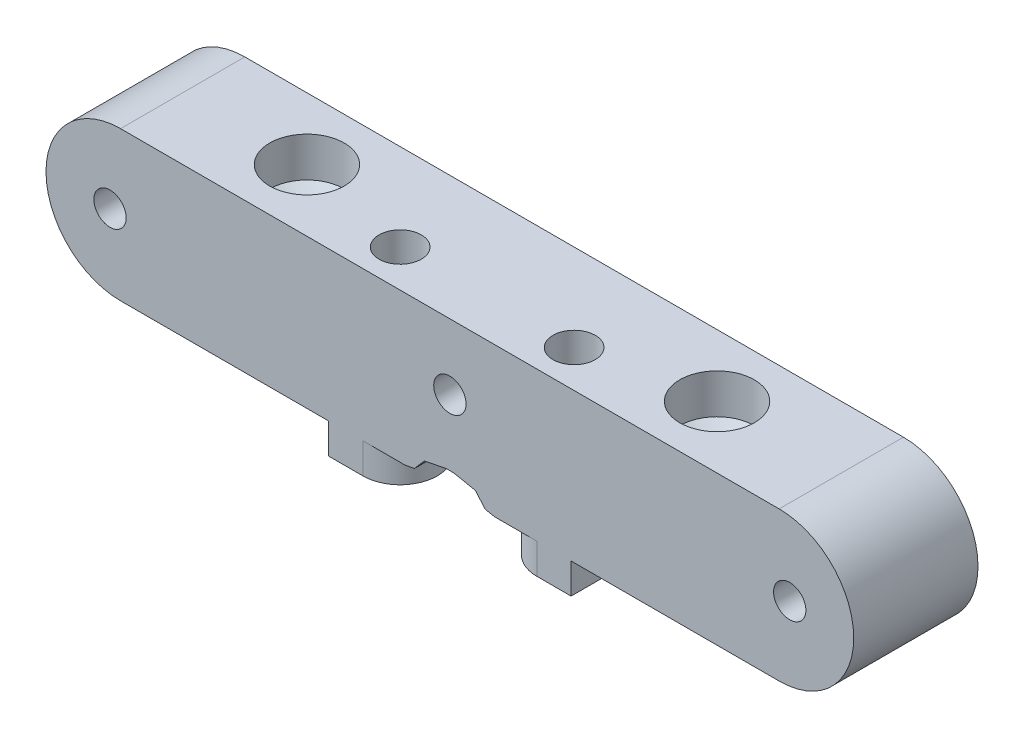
from build123d import *
from build123d.topology import SkipClean

# Parameters (mm, degrees)
SZKIC2_W                    = 45.000061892
SZKIC2_H                    = 10
SZKIC2_R                    = 1.7
DODANIE_WYCI_GNI_CIE1_DEPTH = 12
SZKIC3_W                    = 45.000061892
SZKIC3_H                    = 6.5
DODANIE_WYCI_GNI_CIE2_DEPTH = 14.5
SZKIC4_R                    = 1.7
WYTNIJ_WYCI_GNI_CIE1_DEPTH  = 92.835319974
WYTNIJ_WYCI_GNI_CIE2_DEPTH  = 46.083313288
WYTNIJ_WYCI_GNI_CIE3_DEPTH  = 93.149205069
DODANIE_WYCI_GNI_CIE4_DEPTH = 2.45
OTW_R_4_6_4_6_1_D           = 4.6
OTW_R_4_6_4_6_1_DEPTH       = 4.118020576
OTW_R_4_6_4_6_1_TIP         = 1.381979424
WYTNIJ_WYCI_GNI_CIE4_DEPTH  = 92.835319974
WYTNIJ_WYCI_GNI_CIE5_DEPTH  = 92.835319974
SZKIC18_R                   = 1.7
WYTNIJ_WYCI_GNI_CIE6_DEPTH  = 46.067256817
OTW_R_6_0_6_2_D             = 6
OTW_R_6_0_6_2_DEPTH         = 3.197418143
OTW_R_6_0_6_2_TIP           = 1.802581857
DODANIE_WYCI_GNI_CIE5_DEPTH = 10
SZKIC24_R                   = 1.3
WYTNIJ_WYCI_GNI_CIE8_DEPTH  = 86.225780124
OTW_R_4_6_4_6_2_D           = 4.6
OTW_R_4_6_4_6_2_DEPTH       = 4.618020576
OTW_R_4_6_4_6_2_TIP         = 1.381979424


with BuildPart() as part:
    # Szkic2 → Dodanie-wyci_gni_cie1 (new body)
    with BuildSketch(Plane(origin=(0, 55.165297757, 0), x_dir=(1.0, 3.1724579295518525e-12, 0), z_dir=(-3.1724579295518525e-12, 1.0, 0))):
        with Locations((19.000030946, 5)):
            Rectangle(SZKIC2_W, SZKIC2_H)
        with Locations(Location((35.500059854, 5, 0), (0, 0, 180))):
            Circle(SZKIC2_R, mode=Mode.SUBTRACT)
        with Locations(Location((2.5, 5, 0), (0, 0, 180))):
            Circle(SZKIC2_R, mode=Mode.SUBTRACT)
    extrude(amount=DODANIE_WYCI_GNI_CIE1_DEPTH)

    # Szkic3 → Dodanie-wyci_gni_cie2 (add)
    with BuildSketch(Plane(origin=(0, 67.165297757, 0), x_dir=(1.0, 3.172457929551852e-12, 0), z_dir=(-3.172457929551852e-12, 1.0, 0))):
        with Locations((19.000030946, 3.25)):
            Rectangle(SZKIC3_W, SZKIC3_H)
    extrude(amount=DODANIE_WYCI_GNI_CIE2_DEPTH)

    # Szkic4 → Wytnij-wyci_gni_cie1 (cut, through all)
    with BuildSketch(Plane(origin=(0, 0, -6.5), x_dir=(-1, 0, 0), z_dir=(0, 0, -1))):
        with Locations((-28.000030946, 75.787695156)):
            Circle(SZKIC4_R)
        with Locations((-10.000030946, 75.787695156)):
            Circle(SZKIC4_R)
    extrude(amount=-WYTNIJ_WYCI_GNI_CIE1_DEPTH, mode=Mode.SUBTRACT)

    # Szkic5 → Wytnij-wyci_gni_cie2 (cut, through all)
    with SkipClean():  # the faces are left unmerged after this step: merging them gives an invalid solid
        with BuildSketch(Plane.XZ.offset(-67.165297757)):
            with BuildLine():
                Line((34.700059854, -6.5), (36.300059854, -6.5))
                ThreePointArc((36.300059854, -6.5), (35.500059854, -3.3), (34.700059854, -6.5))
            make_face()
            with BuildLine():
                Line((1.7, -6.5), (3.3, -6.5))
                ThreePointArc((3.3, -6.5), (2.5, -3.3), (1.7, -6.5))
            make_face()
        extrude(amount=-WYTNIJ_WYCI_GNI_CIE2_DEPTH, mode=Mode.SUBTRACT)

    # Szkic7 → Wytnij-wyci_gni_cie3 (cut, through all)
    with SkipClean():  # the faces are left unmerged after this step: merging them gives an invalid solid
        with BuildSketch(Plane(origin=(0, 0, -10), x_dir=(-1, 0, 0), z_dir=(0, 0, -1))):
            Polygon((-18.700467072, 56.579969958), (-19.29959482, 56.579969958), (-21.049804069, 56.23010956), (-21.842673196, 55.315858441), (-28.386226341, 54.006531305), (-29.25589482, 52.945612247), (-29.25589482, 44.934983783), (-28.386229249, 43.874064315), (-21.842674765, 42.564737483), (-21.049803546, 41.650485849), (-19.299594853, 41.300625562), (-18.700465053, 41.300625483), (-16.950258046, 41.65048596), (-16.157389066, 42.564736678), (-9.613832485, 43.874064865), (-8.744167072, 44.934983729), (-8.744167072, 52.945611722), (-9.613832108, 54.006530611), (-16.157387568, 55.315858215), (-16.950258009, 56.230109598), align=None)
        extrude(amount=-WYTNIJ_WYCI_GNI_CIE3_DEPTH, mode=Mode.SUBTRACT)

    # Szkic13 → Dodanie-wyci_gni_cie4 (add)
    with SkipClean():  # the faces are left unmerged after this step: merging them gives an invalid solid
        with BuildSketch(Plane.XZ.offset(-55.165297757)):
            with BuildLine():
                Line((28.75589482, 0), (28.75589482, -6))
                Line((28.75589482, -6), (26.000030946, -6))
                ThreePointArc((26.000030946, -6), (23.000030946, -2.999996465), (26.000038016, 0))
                Line((26.000038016, 0), (28.75589482, 0))
            make_face()
            with BuildLine():
                Line((12.000030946, -6), (9.244167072, -6))
                Line((9.244167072, -6), (9.244167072, 0))
                Line((9.244167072, 0), (12.000021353, 0))
                ThreePointArc((12.000021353, 0), (15.000030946, -2.999995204), (12.000030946, -6))
            make_face()
        extrude(amount=DODANIE_WYCI_GNI_CIE4_DEPTH)

    # Otw_r _4.6 _4.6_1
    with Locations(Plane.XY):
        with Locations((28.000030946, 75.787695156), (10.000030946, 75.787695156)):
            Hole(OTW_R_4_6_4_6_1_D / 2, depth=OTW_R_4_6_4_6_1_DEPTH)
            with Locations((0, 0, -(OTW_R_4_6_4_6_1_DEPTH + OTW_R_4_6_4_6_1_TIP / 2))):  # 118° drill point
                Cone(0, OTW_R_4_6_4_6_1_D / 2, OTW_R_4_6_4_6_1_TIP, mode=Mode.SUBTRACT)

    # Szkic16 → Wytnij-wyci_gni_cie4 (cut, through all)
    with BuildSketch(Plane(origin=(0, 0, -6.5), x_dir=(-1, 0, 0), z_dir=(0, 0, -1))):
        with BuildLine():
            Line((-16.475947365, 81.665297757), (-8.964139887, 79.651233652))
            ThreePointArc((-8.964139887, 79.651233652), (-6.826423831, 78.222488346), (-6.000030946, 75.787695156))
            Line((-6.000030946, 75.787695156), (-6.000030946, 67.165297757))
            Line((-6.000030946, 67.165297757), (3.5, 67.165297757))
            Line((3.5, 67.165297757), (3.5, 81.665297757))
            Line((3.5, 81.665297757), (-16.475947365, 81.665297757))
        make_face()
        with BuildLine():
            Line((-29.035922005, 79.651233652), (-21.524114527, 81.665297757))
            Line((-21.524114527, 81.665297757), (-41.500061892, 81.665297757))
            Line((-41.500061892, 81.665297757), (-41.500061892, 67.165297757))
            Line((-41.500061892, 67.165297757), (-32.000030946, 67.165297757))
            Line((-32.000030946, 67.165297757), (-32.000030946, 75.787695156))
            ThreePointArc((-32.000030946, 75.787695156), (-31.173638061, 78.222488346), (-29.035922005, 79.651233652))
        make_face()
    extrude(amount=-WYTNIJ_WYCI_GNI_CIE4_DEPTH, mode=Mode.SUBTRACT)

    # Szkic17 → Wytnij-wyci_gni_cie5 (cut, through all)
    with BuildSketch(Plane(origin=(0, 0, -6.5), x_dir=(-1, 0, 0), z_dir=(0, 0, -1))):
        with BuildLine():
            Line((-8.964139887, 79.651233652), (-16.475947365, 81.665297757))
            Line((-16.475947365, 81.665297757), (-21.524114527, 81.665297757))
            Line((-21.524114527, 81.665297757), (-29.035922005, 79.651233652))
            ThreePointArc((-29.035922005, 79.651233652), (-31.173638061, 78.222488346), (-32.000030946, 75.787695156))
            Line((-32.000030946, 75.787695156), (-32.000030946, 67.165297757))
            Line((-32.000030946, 67.165297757), (-6.000030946, 67.165297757))
            Line((-6.000030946, 67.165297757), (-6.000030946, 75.787695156))
            ThreePointArc((-6.000030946, 75.787695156), (-6.826423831, 78.222488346), (-8.964139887, 79.651233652))
        make_face()
    extrude(amount=-WYTNIJ_WYCI_GNI_CIE5_DEPTH, mode=Mode.SUBTRACT)

    # Szkic18 → Wytnij-wyci_gni_cie6 (cut, through all)
    with BuildSketch(Plane.XZ.offset(-52.715297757)):
        with Locations((12.000030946, -3)):
            Circle(SZKIC18_R)
        with Locations((26.000030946, -3)):
            Circle(SZKIC18_R)
    extrude(amount=-WYTNIJ_WYCI_GNI_CIE6_DEPTH, mode=Mode.SUBTRACT)

    # Otw_r _6.0 _6_2
    with Locations(Plane(origin=(0, 67.165297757, 0), x_dir=(1.0, 3.172457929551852e-12, 0), z_dir=(-3.172457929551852e-12, 1.0, 0))):
        with Locations((35.500059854, 5), (2.5, 5)):
            Hole(OTW_R_6_0_6_2_D / 2, depth=OTW_R_6_0_6_2_DEPTH)
            with Locations((0, 0, -(OTW_R_6_0_6_2_DEPTH + OTW_R_6_0_6_2_TIP / 2))):  # 118° drill point
                Cone(0, OTW_R_6_0_6_2_D / 2, OTW_R_6_0_6_2_TIP, mode=Mode.SUBTRACT)

    # Szkic27 → Dodanie-wyci_gni_cie5 (add)
    with BuildSketch(Plane(origin=(0, 0, -10), x_dir=(-1, 0, 0), z_dir=(0, 0, -1))):
        with BuildLine():
            Line((-45.500061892, 67.165297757), (-41.500061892, 67.165297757))
            Line((-41.500061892, 67.165297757), (-41.500061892, 55.165297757))
            Line((-41.500061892, 55.165297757), (-45.500061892, 55.165297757))
            ThreePointArc((-45.500061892, 55.165297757), (-51.500061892, 61.165297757), (-45.500061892, 67.165297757))
        make_face()
        with BuildLine():
            Line((3.5, 67.165297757), (7.5, 67.165297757))
            ThreePointArc((7.5, 67.165297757), (13.5, 61.165297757), (7.5, 55.165297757))
            Line((7.5, 55.165297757), (3.5, 55.165297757))
            Line((3.5, 55.165297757), (3.5, 67.165297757))
        make_face()
    extrude(amount=-DODANIE_WYCI_GNI_CIE5_DEPTH)

    # Szkic24 → Wytnij-wyci_gni_cie8 (cut, through all)
    with BuildSketch(Plane(origin=(0, 0, -10), x_dir=(-1, 0, 0), z_dir=(0, 0, -1))):
        with Locations((-19.000030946, 61.872633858)):
            Circle(SZKIC24_R)
        with Locations((-46.350061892, 61.165297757)):
            Circle(SZKIC24_R)
        with Locations((8.35, 61.165297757)):
            Circle(SZKIC24_R)
    extrude(amount=-WYTNIJ_WYCI_GNI_CIE8_DEPTH, mode=Mode.SUBTRACT)

    # Otw_r _4.6 _4.6_2
    with Locations(Plane(origin=(0, 0, -10), x_dir=(-1, 0, 0), z_dir=(0, 0, -1))):
        with Locations((-19.000030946, 61.872633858), (-46.350061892, 61.165297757), (8.35, 61.165297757)):
            Hole(OTW_R_4_6_4_6_2_D / 2, depth=OTW_R_4_6_4_6_2_DEPTH)
            with Locations((0, 0, -(OTW_R_4_6_4_6_2_DEPTH + OTW_R_4_6_4_6_2_TIP / 2))):  # 118° drill point
                Cone(0, OTW_R_4_6_4_6_2_D / 2, OTW_R_4_6_4_6_2_TIP, mode=Mode.SUBTRACT)


solid = part.part
